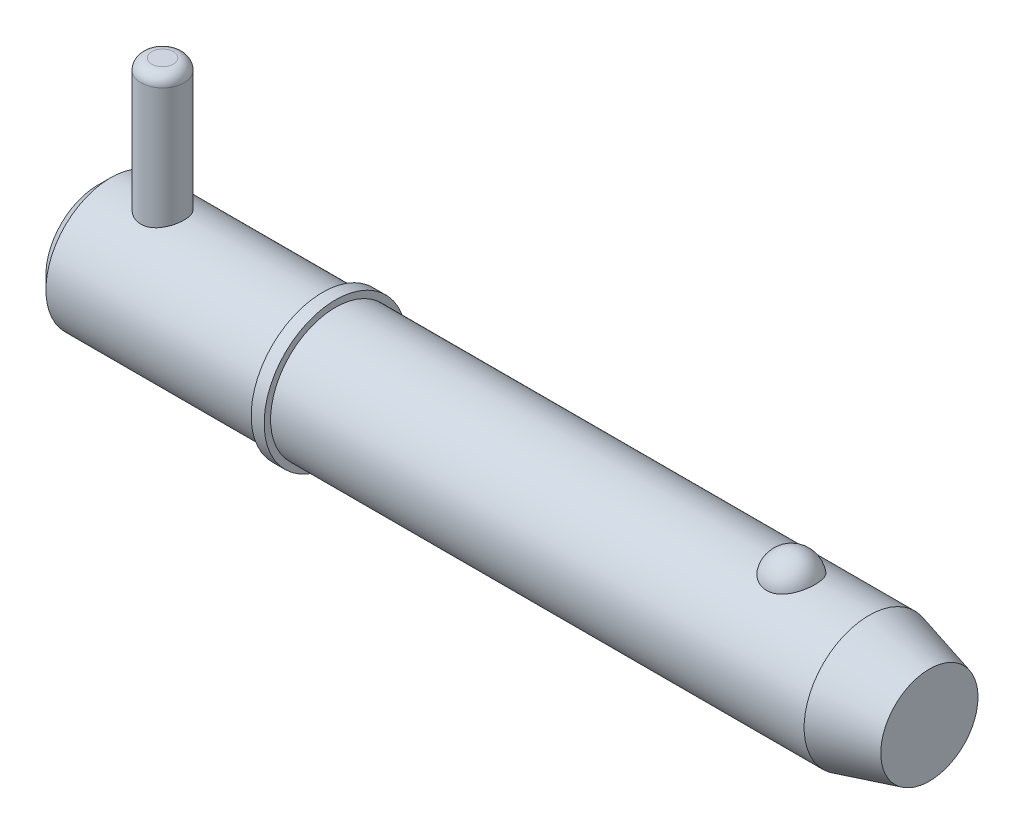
ISO-10303-21;
HEADER;
FILE_DESCRIPTION(('STEP AP214'),'2;1');
FILE_NAME('part.step','',(''),(''),'','','');
FILE_SCHEMA(('AUTOMOTIVE_DESIGN { 1 0 10303 214 1 1 1 1 }'));
ENDSEC;
DATA;
#1=APPLICATION_CONTEXT('core data for automotive mechanical design processes');
#2=APPLICATION_PROTOCOL_DEFINITION('international standard','automotive_design',2000,#1);
#3=PRODUCT_CONTEXT('',#1,'mechanical');
#4=PRODUCT('Part','Part','',(#3));
#5=PRODUCT_RELATED_PRODUCT_CATEGORY('part','',(#4));
#6=PRODUCT_DEFINITION_FORMATION('','',#4);
#7=PRODUCT_DEFINITION_CONTEXT('part definition',#1,'design');
#8=PRODUCT_DEFINITION('design','',#6,#7);
#9=PRODUCT_DEFINITION_SHAPE('','',#8);
#10=(LENGTH_UNIT() NAMED_UNIT(*) SI_UNIT(.MILLI.,.METRE.));
#11=(NAMED_UNIT(*) PLANE_ANGLE_UNIT() SI_UNIT($,.RADIAN.));
#12=(NAMED_UNIT(*) SI_UNIT($,.STERADIAN.) SOLID_ANGLE_UNIT());
#13=UNCERTAINTY_MEASURE_WITH_UNIT(LENGTH_MEASURE(1.E-05),#10,'distance_accuracy_value','');
#14=(GEOMETRIC_REPRESENTATION_CONTEXT(3) GLOBAL_UNCERTAINTY_ASSIGNED_CONTEXT((#13)) GLOBAL_UNIT_ASSIGNED_CONTEXT((#10,
#11,#12)) REPRESENTATION_CONTEXT('',''));
#15=CARTESIAN_POINT('',(0.,0.,0.));
#16=DIRECTION('',(0.,0.,1.));
#17=DIRECTION('',(1.,0.,0.));
#18=AXIS2_PLACEMENT_3D('',#15,#16,#17);
#19=CARTESIAN_POINT('',(9.525,28.575,0.));
#20=DIRECTION('',(0.,-1.,0.));
#21=DIRECTION('',(0.,0.,-1.));
#22=AXIS2_PLACEMENT_3D('',#19,#20,#21);
#23=CYLINDRICAL_SURFACE('',#22,3.175);
#24=CARTESIAN_POINT('',(9.525,-7.93750000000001,0.));
#25=DIRECTION('',(0.,1.,0.));
#26=DIRECTION('',(0.,0.,1.));
#27=AXIS2_PLACEMENT_3D('',#24,#25,#26);
#28=CIRCLE('',#27,3.175);
#29=CARTESIAN_POINT('',(9.525,-7.93750000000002,-3.175));
#30=VERTEX_POINT('',#29);
#31=EDGE_CURVE('P0_E25',#30,#30,#28,.T.);
#32=CARTESIAN_POINT('',(9.525,26.9875,0.));
#33=DIRECTION('',(0.,1.,0.));
#34=DIRECTION('',(0.,0.,1.));
#35=AXIS2_PLACEMENT_3D('',#32,#33,#34);
#36=CIRCLE('',#35,3.175);
#37=CARTESIAN_POINT('',(9.525,26.9875,-3.175));
#38=VERTEX_POINT('',#37);
#39=EDGE_CURVE('P0_E29',#38,#38,#36,.F.);
#40=CARTESIAN_POINT('',(9.525,-7.93750000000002,-3.175));
#41=CARTESIAN_POINT('',(9.525,-7.57369791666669,-3.175));
#42=CARTESIAN_POINT('',(9.525,-7.20989583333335,-3.175));
#43=CARTESIAN_POINT('',(9.525,-6.48229166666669,-3.175));
#44=CARTESIAN_POINT('',(9.525,-6.11848958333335,-3.175));
#45=CARTESIAN_POINT('',(9.525,-5.39088541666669,-3.175));
#46=CARTESIAN_POINT('',(9.525,-5.02708333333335,-3.175));
#47=CARTESIAN_POINT('',(9.525,-4.29947916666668,-3.175));
#48=CARTESIAN_POINT('',(9.525,-3.93567708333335,-3.175));
#49=CARTESIAN_POINT('',(9.525,-3.20807291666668,-3.175));
#50=CARTESIAN_POINT('',(9.525,-2.84427083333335,-3.175));
#51=CARTESIAN_POINT('',(9.525,-2.11666666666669,-3.175));
#52=CARTESIAN_POINT('',(9.525,-1.75286458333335,-3.175));
#53=CARTESIAN_POINT('',(9.525,-1.02526041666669,-3.175));
#54=CARTESIAN_POINT('',(9.525,-0.661458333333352,-3.175));
#55=CARTESIAN_POINT('',(9.525,0.0661458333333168,-3.175));
#56=CARTESIAN_POINT('',(9.525,0.429947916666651,-3.175));
#57=CARTESIAN_POINT('',(9.525,1.15755208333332,-3.175));
#58=CARTESIAN_POINT('',(9.525,1.52135416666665,-3.175));
#59=CARTESIAN_POINT('',(9.525,2.24895833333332,-3.175));
#60=CARTESIAN_POINT('',(9.525,2.61276041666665,-3.175));
#61=CARTESIAN_POINT('',(9.525,3.34036458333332,-3.175));
#62=CARTESIAN_POINT('',(9.525,3.70416666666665,-3.175));
#63=CARTESIAN_POINT('',(9.525,4.43177083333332,-3.175));
#64=CARTESIAN_POINT('',(9.525,4.79557291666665,-3.175));
#65=CARTESIAN_POINT('',(9.525,5.52317708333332,-3.175));
#66=CARTESIAN_POINT('',(9.525,5.88697916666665,-3.175));
#67=CARTESIAN_POINT('',(9.525,6.61458333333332,-3.175));
#68=CARTESIAN_POINT('',(9.525,6.97838541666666,-3.175));
#69=CARTESIAN_POINT('',(9.525,7.70598958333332,-3.175));
#70=CARTESIAN_POINT('',(9.525,8.06979166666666,-3.175));
#71=CARTESIAN_POINT('',(9.525,8.79739583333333,-3.175));
#72=CARTESIAN_POINT('',(9.525,9.16119791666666,-3.175));
#73=CARTESIAN_POINT('',(9.525,9.88880208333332,-3.175));
#74=CARTESIAN_POINT('',(9.525,10.2526041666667,-3.175));
#75=CARTESIAN_POINT('',(9.525,10.9802083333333,-3.175));
#76=CARTESIAN_POINT('',(9.525,11.3440104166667,-3.175));
#77=CARTESIAN_POINT('',(9.525,12.0716145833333,-3.175));
#78=CARTESIAN_POINT('',(9.525,12.4354166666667,-3.175));
#79=CARTESIAN_POINT('',(9.525,13.1630208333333,-3.175));
#80=CARTESIAN_POINT('',(9.525,13.5268229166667,-3.175));
#81=CARTESIAN_POINT('',(9.525,14.2544270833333,-3.175));
#82=CARTESIAN_POINT('',(9.525,14.6182291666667,-3.175));
#83=CARTESIAN_POINT('',(9.525,15.3458333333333,-3.175));
#84=CARTESIAN_POINT('',(9.525,15.7096354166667,-3.175));
#85=CARTESIAN_POINT('',(9.525,16.4372395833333,-3.175));
#86=CARTESIAN_POINT('',(9.525,16.8010416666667,-3.175));
#87=CARTESIAN_POINT('',(9.525,17.5286458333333,-3.175));
#88=CARTESIAN_POINT('',(9.525,17.8924479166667,-3.175));
#89=CARTESIAN_POINT('',(9.525,18.6200520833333,-3.175));
#90=CARTESIAN_POINT('',(9.525,18.9838541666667,-3.175));
#91=CARTESIAN_POINT('',(9.525,19.7114583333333,-3.175));
#92=CARTESIAN_POINT('',(9.525,20.0752604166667,-3.175));
#93=CARTESIAN_POINT('',(9.525,20.8028645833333,-3.175));
#94=CARTESIAN_POINT('',(9.525,21.1666666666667,-3.175));
#95=CARTESIAN_POINT('',(9.525,21.8942708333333,-3.175));
#96=CARTESIAN_POINT('',(9.525,22.2580729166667,-3.175));
#97=CARTESIAN_POINT('',(9.525,22.9856770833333,-3.175));
#98=CARTESIAN_POINT('',(9.525,23.3494791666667,-3.175));
#99=CARTESIAN_POINT('',(9.525,24.0770833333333,-3.175));
#100=CARTESIAN_POINT('',(9.525,24.4408854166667,-3.175));
#101=CARTESIAN_POINT('',(9.525,25.1684895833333,-3.175));
#102=CARTESIAN_POINT('',(9.525,25.5322916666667,-3.175));
#103=CARTESIAN_POINT('',(9.525,26.2598958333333,-3.175));
#104=CARTESIAN_POINT('',(9.525,26.6236979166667,-3.175));
#105=CARTESIAN_POINT('',(9.525,26.9875,-3.175));
#106=B_SPLINE_CURVE_WITH_KNOTS('',3,(#40,#41,#42,#43,#44,#45,#46,#47,#48,#49,#50,#51,#52,#53,
#54,#55,#56,#57,#58,#59,#60,#61,#62,#63,#64,#65,#66,#67,#68,#69,#70,#71,#72,#73,#74,#75,#76,#77,
#78,#79,#80,#81,#82,#83,#84,#85,#86,#87,#88,#89,#90,#91,#92,#93,#94,#95,#96,#97,#98,#99,#100,
#101,#102,#103,#104,#105),.UNSPECIFIED.,.F.,.F.,(4,2,2,2,2,2,2,2,2,2,2,2,2,2,2,2,2,2,2,2,2,2,2,
2,2,2,2,2,2,2,2,2,4),(0.,1.09140625,2.1828125,3.27421875,4.365625,5.45703125,6.5484375,
7.63984375,8.73125000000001,9.82265625,10.9140625,12.00546875,13.096875,14.18828125,15.2796875,
16.37109375,17.4625,18.55390625,19.6453125,20.73671875,21.828125,22.91953125,24.0109375,
25.10234375,26.19375,27.28515625,28.3765625,29.46796875,30.559375,31.65078125,32.7421875,
33.83359375,34.925),.UNSPECIFIED.);
#107=EDGE_CURVE('P0_BSEAM14',#30,#38,#106,.T.);
#108=ORIENTED_EDGE('',*,*,#31,.T.);
#109=ORIENTED_EDGE('',*,*,#39,.T.);
#110=ORIENTED_EDGE('',*,*,#107,.T.);
#111=ORIENTED_EDGE('',*,*,#107,.F.);
#112=EDGE_LOOP('',(#108,#110,#109,#111));
#113=FACE_BOUND('',#112,.T.);
#114=ADVANCED_FACE('P0_F14',(#113),#23,.T.);
#115=CARTESIAN_POINT('',(9.525,28.575,0.));
#116=DIRECTION('',(0.,1.,0.));
#117=DIRECTION('',(0.,0.,1.));
#118=AXIS2_PLACEMENT_3D('',#115,#116,#117);
#119=PLANE('',#118);
#120=CARTESIAN_POINT('',(9.525,28.575,0.));
#121=DIRECTION('',(0.,1.,0.));
#122=DIRECTION('',(0.,0.,1.));
#123=AXIS2_PLACEMENT_3D('',#120,#121,#122);
#124=CIRCLE('',#123,1.5875);
#125=CARTESIAN_POINT('',(9.525,28.575,1.5875));
#126=VERTEX_POINT('',#125);
#127=EDGE_CURVE('P0_E10',#126,#126,#124,.T.);
#128=ORIENTED_EDGE('',*,*,#127,.T.);
#129=EDGE_LOOP('',(#128));
#130=FACE_BOUND('',#129,.T.);
#131=ADVANCED_FACE('P0_F46',(#130),#119,.T.);
#132=CARTESIAN_POINT('',(9.525,-9.525,0.));
#133=DIRECTION('',(0.,1.,0.));
#134=DIRECTION('',(0.,0.,1.));
#135=AXIS2_PLACEMENT_3D('',#132,#133,#134);
#136=PLANE('',#135);
#137=CARTESIAN_POINT('',(9.525,-9.525,0.));
#138=DIRECTION('',(0.,1.,0.));
#139=DIRECTION('',(0.,0.,1.));
#140=AXIS2_PLACEMENT_3D('',#137,#138,#139);
#141=CIRCLE('',#140,1.5875);
#142=CARTESIAN_POINT('',(9.525,-9.525,1.5875));
#143=VERTEX_POINT('',#142);
#144=EDGE_CURVE('P0_E21',#143,#143,#141,.F.);
#145=ORIENTED_EDGE('',*,*,#144,.T.);
#146=EDGE_LOOP('',(#145));
#147=FACE_BOUND('',#146,.T.);
#148=ADVANCED_FACE('P0_F43',(#147),#136,.F.);
#149=CARTESIAN_POINT('',(9.525,-7.9375,0.));
#150=DIRECTION('',(0.,1.,0.));
#151=DIRECTION('',(0.,0.,1.));
#152=AXIS2_PLACEMENT_3D('',#149,#150,#151);
#153=DEGENERATE_TOROIDAL_SURFACE('',#152,1.5875,1.5875,.T.);
#154=ORIENTED_EDGE('',*,*,#144,.F.);
#155=EDGE_LOOP('',(#154));
#156=FACE_BOUND('',#155,.T.);
#157=ORIENTED_EDGE('',*,*,#31,.F.);
#158=EDGE_LOOP('',(#157));
#159=FACE_BOUND('',#158,.T.);
#160=ADVANCED_FACE('P0_F38',(#156,#159),#153,.T.);
#161=CARTESIAN_POINT('',(9.525,26.9875,0.));
#162=DIRECTION('',(0.,1.,0.));
#163=DIRECTION('',(0.,0.,1.));
#164=AXIS2_PLACEMENT_3D('',#161,#162,#163);
#165=DEGENERATE_TOROIDAL_SURFACE('',#164,1.5875,1.5875,.T.);
#166=ORIENTED_EDGE('',*,*,#39,.F.);
#167=EDGE_LOOP('',(#166));
#168=FACE_BOUND('',#167,.T.);
#169=ORIENTED_EDGE('',*,*,#127,.F.);
#170=EDGE_LOOP('',(#169));
#171=FACE_BOUND('',#170,.T.);
#172=ADVANCED_FACE('P0_F16',(#168,#171),#165,.T.);
#173=CLOSED_SHELL('',(#114,#131,#148,#160,#172));
#174=MANIFOLD_SOLID_BREP('P0_B1',#173);
#175=CARTESIAN_POINT('',(0.,0.,0.));
#176=DIRECTION('',(1.,0.,0.));
#177=DIRECTION('',(0.,0.,-1.));
#178=AXIS2_PLACEMENT_3D('',#175,#176,#177);
#179=CYLINDRICAL_SURFACE('',#178,9.525);
#180=CARTESIAN_POINT('',(113.343054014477,0.,0.));
#181=DIRECTION('',(1.,0.,0.));
#182=DIRECTION('',(0.,0.,-1.));
#183=AXIS2_PLACEMENT_3D('',#180,#181,#182);
#184=CIRCLE('',#183,9.525);
#185=CARTESIAN_POINT('',(113.343054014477,0.,-9.525));
#186=VERTEX_POINT('',#185);
#187=EDGE_CURVE('P1_E81',#186,#186,#184,.T.);
#188=ORIENTED_EDGE('',*,*,#187,.F.);
#189=EDGE_LOOP('',(#188));
#190=FACE_BOUND('',#189,.T.);
#191=CARTESIAN_POINT('',(34.93,0.,0.));
#192=DIRECTION('',(1.,0.,0.));
#193=DIRECTION('',(0.,0.,-1.));
#194=AXIS2_PLACEMENT_3D('',#191,#192,#193);
#195=CIRCLE('',#194,9.525);
#196=CARTESIAN_POINT('',(34.93,0.,-9.525));
#197=VERTEX_POINT('',#196);
#198=EDGE_CURVE('P1_E85',#197,#197,#195,.T.);
#199=ORIENTED_EDGE('',*,*,#198,.T.);
#200=EDGE_LOOP('',(#199));
#201=FACE_BOUND('',#200,.T.);
#202=CARTESIAN_POINT('',(101.945757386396,8.80405803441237,3.63513233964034));
#203=CARTESIAN_POINT('',(101.851676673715,8.80405953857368,3.63513053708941));
#204=CARTESIAN_POINT('',(101.757561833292,8.80561325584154,3.63137461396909));
#205=CARTESIAN_POINT('',(101.570012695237,8.81177748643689,3.61638665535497));
#206=CARTESIAN_POINT('',(101.476578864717,8.81638992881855,3.60514990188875));
#207=CARTESIAN_POINT('',(101.197945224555,8.83467114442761,3.56024627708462));
#208=CARTESIAN_POINT('',(101.014691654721,8.85278327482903,3.5153862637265));
#209=CARTESIAN_POINT('',(100.659509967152,8.89871214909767,3.39742145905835));
#210=CARTESIAN_POINT('',(100.487553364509,8.92650327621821,3.32439116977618));
#211=CARTESIAN_POINT('',(100.158707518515,8.98874819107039,3.15220244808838));
#212=CARTESIAN_POINT('',(100.001811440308,9.02319893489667,3.05305594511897));
#213=CARTESIAN_POINT('',(99.7022147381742,9.09629186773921,2.82797815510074));
#214=CARTESIAN_POINT('',(99.5600600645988,9.13502685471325,2.70135138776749));
#215=CARTESIAN_POINT('',(99.2982999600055,9.2118657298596,2.42641932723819));
#216=CARTESIAN_POINT('',(99.1787015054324,9.2499694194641,2.27810735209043));
#217=CARTESIAN_POINT('',(98.959645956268,9.32341082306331,1.95652290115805));
#218=CARTESIAN_POINT('',(98.8613174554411,9.35855090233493,1.78243511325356));
#219=CARTESIAN_POINT('',(98.6938190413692,9.42045142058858,1.41937246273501));
#220=CARTESIAN_POINT('',(98.6246511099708,9.44721128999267,1.23039658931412));
#221=CARTESIAN_POINT('',(98.5161994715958,9.48990641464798,0.84037088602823));
#222=CARTESIAN_POINT('',(98.4772880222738,9.50570658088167,0.639202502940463));
#223=CARTESIAN_POINT('',(98.4315550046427,9.52433146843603,0.23266436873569));
#224=CARTESIAN_POINT('',(98.4247324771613,9.52715657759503,0.0272947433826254));
#225=CARTESIAN_POINT('',(98.443255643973,9.51956918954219,-0.380478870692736));
#226=CARTESIAN_POINT('',(98.4684052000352,9.50923740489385,-0.582893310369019));
#227=CARTESIAN_POINT('',(98.5500253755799,9.47651897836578,-0.980293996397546));
#228=CARTESIAN_POINT('',(98.6064966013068,9.45413210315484,-1.17528009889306));
#229=CARTESIAN_POINT('',(98.7497192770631,9.39954044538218,-1.55263697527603));
#230=CARTESIAN_POINT('',(98.8365124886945,9.36732213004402,-1.73498993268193));
#231=CARTESIAN_POINT('',(99.0386103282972,9.29640700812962,-2.08177763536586));
#232=CARTESIAN_POINT('',(99.1539172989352,9.25770966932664,-2.24621090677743));
#233=CARTESIAN_POINT('',(99.411264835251,9.17775604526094,-2.55338333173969));
#234=CARTESIAN_POINT('',(99.5534344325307,9.136488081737,-2.69601150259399));
#235=CARTESIAN_POINT('',(99.86089985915,9.05620497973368,-2.95451229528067));
#236=CARTESIAN_POINT('',(100.026193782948,9.01718965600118,-3.070387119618));
#237=CARTESIAN_POINT('',(100.372052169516,8.94680019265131,-3.26976836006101));
#238=CARTESIAN_POINT('',(100.552227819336,8.91528408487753,-3.353897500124));
#239=CARTESIAN_POINT('',(100.925651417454,8.86272514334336,-3.49043503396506));
#240=CARTESIAN_POINT('',(101.118894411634,8.84167836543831,-3.54285537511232));
#241=CARTESIAN_POINT('',(101.502503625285,8.81348056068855,-3.61241306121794));
#242=CARTESIAN_POINT('',(101.692525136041,8.80568348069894,-3.6311933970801));
#243=CARTESIAN_POINT('',(102.073190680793,8.80289410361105,-3.63795342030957));
#244=CARTESIAN_POINT('',(102.263834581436,8.80789922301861,-3.62593932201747));
#245=CARTESIAN_POINT('',(102.634007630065,8.82974915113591,-3.57238430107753));
#246=CARTESIAN_POINT('',(102.813697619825,8.84621463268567,-3.53178890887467));
#247=CARTESIAN_POINT('',(103.163422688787,8.88875330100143,-3.42331083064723));
#248=CARTESIAN_POINT('',(103.333456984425,8.91482726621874,-3.35542593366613));
#249=CARTESIAN_POINT('',(103.663237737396,8.97448239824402,-3.19248225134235));
#250=CARTESIAN_POINT('',(103.822680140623,9.00821446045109,-3.0968647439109));
#251=CARTESIAN_POINT('',(104.123513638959,9.07935398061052,-2.88162736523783));
#252=CARTESIAN_POINT('',(104.264900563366,9.11676228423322,-2.76200196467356));
#253=CARTESIAN_POINT('',(104.53331931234,9.19347419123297,-2.49516285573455));
#254=CARTESIAN_POINT('',(104.659275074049,9.23277872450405,-2.34686614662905));
#255=CARTESIAN_POINT('',(104.885522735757,9.3073761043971,-2.0309368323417));
#256=CARTESIAN_POINT('',(104.98581004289,9.34266823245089,-1.86330077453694));
#257=CARTESIAN_POINT('',(105.161514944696,9.40674710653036,-1.50744893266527));
#258=CARTESIAN_POINT('',(105.236041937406,9.43529176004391,-1.31874876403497));
#259=CARTESIAN_POINT('',(105.35416505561,9.48144132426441,-0.930631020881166));
#260=CARTESIAN_POINT('',(105.397760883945,9.49904612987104,-0.73121334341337));
#261=CARTESIAN_POINT('',(105.453158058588,9.5215314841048,-0.327147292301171));
#262=CARTESIAN_POINT('',(105.464935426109,9.52640243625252,-0.12249509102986));
#263=CARTESIAN_POINT('',(105.456382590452,9.5228957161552,0.286018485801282));
#264=CARTESIAN_POINT('',(105.43605305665,9.5145183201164,0.489879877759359));
#265=CARTESIAN_POINT('',(105.363884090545,9.48544083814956,0.889994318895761));
#266=CARTESIAN_POINT('',(105.312199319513,9.46480124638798,1.08627971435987));
#267=CARTESIAN_POINT('',(105.178491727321,9.41333895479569,1.46682086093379));
#268=CARTESIAN_POINT('',(105.096466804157,9.38251554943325,1.65107577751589));
#269=CARTESIAN_POINT('',(104.90319292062,9.31365636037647,2.00346348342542));
#270=CARTESIAN_POINT('',(104.791783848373,9.27558138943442,2.17150083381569));
#271=CARTESIAN_POINT('',(104.542294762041,9.19638714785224,2.48563115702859));
#272=CARTESIAN_POINT('',(104.404216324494,9.15526805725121,2.63172542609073));
#273=CARTESIAN_POINT('',(104.104843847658,9.07465393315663,2.89750997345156));
#274=CARTESIAN_POINT('',(103.943610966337,9.03515496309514,3.01726776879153));
#275=CARTESIAN_POINT('',(103.601613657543,8.96227564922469,3.22732920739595));
#276=CARTESIAN_POINT('',(103.420841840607,8.92889763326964,3.31762165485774));
#277=CARTESIAN_POINT('',(103.051445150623,8.8734538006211,3.46314419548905));
#278=CARTESIAN_POINT('',(102.86332371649,8.85102983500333,3.51950082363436));
#279=CARTESIAN_POINT('',(102.57578699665,8.8266696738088,3.57993683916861));
#280=CARTESIAN_POINT('',(102.479133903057,8.82009725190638,3.5960621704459));
#281=CARTESIAN_POINT('',(102.284677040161,8.81020897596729,3.62022512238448));
#282=CARTESIAN_POINT('',(102.18687410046,8.80689090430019,3.62826825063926));
#283=CARTESIAN_POINT('',(102.041224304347,8.80445615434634,3.63416760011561));
#284=CARTESIAN_POINT('',(101.993495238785,8.80405727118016,3.63513325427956));
#285=CARTESIAN_POINT('',(101.945757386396,8.80405803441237,3.63513233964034));
#286=B_SPLINE_CURVE_WITH_KNOTS('',3,(#202,#203,#204,#205,#206,#207,#208,#209,#210,#211,#212,
#213,#214,#215,#216,#217,#218,#219,#220,#221,#222,#223,#224,#225,#226,#227,#228,#229,#230,#231,
#232,#233,#234,#235,#236,#237,#238,#239,#240,#241,#242,#243,#244,#245,#246,#247,#248,#249,#250,
#251,#252,#253,#254,#255,#256,#257,#258,#259,#260,#261,#262,#263,#264,#265,#266,#267,#268,#269,
#270,#271,#272,#273,#274,#275,#276,#277,#278,#279,#280,#281,#282,#283,#284,#285),.UNSPECIFIED.,
.T.,.F.,(4,2,2,2,2,2,2,2,2,2,2,2,2,2,2,2,2,2,2,2,2,2,2,2,2,2,2,2,2,2,2,2,2,2,2,2,2,2,2,2,2,4),
(0.,0.282202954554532,0.564584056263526,1.13017050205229,1.69427128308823,2.25811483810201,
2.83836627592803,3.4187968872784,4.02497117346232,4.63118665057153,5.24474754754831,
5.85829010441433,6.46808687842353,7.07789545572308,7.68854723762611,8.29924920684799,
8.91296283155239,9.52662591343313,10.1275338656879,10.7282152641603,11.2986646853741,
11.8689989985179,12.4213015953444,12.973648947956,13.5380053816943,14.1024919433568,
14.695298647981,15.2882113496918,15.8999469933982,16.5116885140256,17.1238909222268,
17.7360805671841,18.3452748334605,18.9545113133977,19.567138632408,20.179729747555,
20.7907316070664,21.4019653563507,21.9915938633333,22.2859053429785,22.5800161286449,
22.7232098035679),.UNSPECIFIED.);
#287=CARTESIAN_POINT('',(101.945757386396,8.80405803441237,3.63513233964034));
#288=VERTEX_POINT('',#287);
#289=EDGE_CURVE('P1_E35',#288,#288,#286,.T.);
#290=ORIENTED_EDGE('',*,*,#289,.T.);
#291=EDGE_LOOP('',(#290));
#292=FACE_BOUND('',#291,.T.);
#293=ADVANCED_FACE('P1_F13',(#190,#201,#292),#179,.T.);
#294=CARTESIAN_POINT('',(0.,0.,0.));
#295=DIRECTION('',(-1.,0.,0.));
#296=DIRECTION('',(0.,0.,1.));
#297=AXIS2_PLACEMENT_3D('',#294,#295,#296);
#298=PLANE('',#297);
#299=CARTESIAN_POINT('',(0.,0.,0.));
#300=DIRECTION('',(1.,0.,0.));
#301=DIRECTION('',(0.,0.,-1.));
#302=AXIS2_PLACEMENT_3D('',#299,#300,#301);
#303=CIRCLE('',#302,7.62);
#304=CARTESIAN_POINT('',(0.,0.,-7.62));
#305=VERTEX_POINT('',#304);
#306=EDGE_CURVE('P1_E9',#305,#305,#303,.T.);
#307=ORIENTED_EDGE('',*,*,#306,.F.);
#308=EDGE_LOOP('',(#307));
#309=FACE_BOUND('',#308,.T.);
#310=ADVANCED_FACE('P1_F15',(#309),#298,.T.);
#311=CARTESIAN_POINT('',(1.90499999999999,0.,0.));
#312=DIRECTION('',(1.,0.,0.));
#313=DIRECTION('',(0.,0.,-1.));
#314=AXIS2_PLACEMENT_3D('',#311,#312,#313);
#315=CONICAL_SURFACE('',#314,9.525,0.785398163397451);
#316=ORIENTED_EDGE('',*,*,#306,.T.);
#317=EDGE_LOOP('',(#316));
#318=FACE_BOUND('',#317,.T.);
#319=CARTESIAN_POINT('',(1.90499999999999,0.,0.));
#320=DIRECTION('',(1.,0.,0.));
#321=DIRECTION('',(0.,0.,-1.));
#322=AXIS2_PLACEMENT_3D('',#319,#320,#321);
#323=CIRCLE('',#322,9.525);
#324=CARTESIAN_POINT('',(1.90499999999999,0.,-9.525));
#325=VERTEX_POINT('',#324);
#326=EDGE_CURVE('P1_E26',#325,#325,#323,.T.);
#327=ORIENTED_EDGE('',*,*,#326,.F.);
#328=EDGE_LOOP('',(#327));
#329=FACE_BOUND('',#328,.T.);
#330=ADVANCED_FACE('P1_F77',(#318,#329),#315,.T.);
#331=CARTESIAN_POINT('',(0.,0.,0.));
#332=DIRECTION('',(1.,0.,0.));
#333=DIRECTION('',(0.,0.,-1.));
#334=AXIS2_PLACEMENT_3D('',#331,#332,#333);
#335=CYLINDRICAL_SURFACE('',#334,9.525);
#336=CARTESIAN_POINT('',(9.525,-8.98025612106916,3.175));
#337=CARTESIAN_POINT('',(9.35206354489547,-8.98025555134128,3.17500081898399));
#338=CARTESIAN_POINT('',(9.17913201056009,-8.98530617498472,3.16082293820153));
#339=CARTESIAN_POINT('',(8.83839221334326,-9.00485797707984,3.10467734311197));
#340=CARTESIAN_POINT('',(8.67058479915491,-9.0193607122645,3.06270505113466));
#341=CARTESIAN_POINT('',(8.34508461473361,-9.05599546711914,2.95260866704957));
#342=CARTESIAN_POINT('',(8.18737272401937,-9.07811252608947,2.88453582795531));
#343=CARTESIAN_POINT('',(7.88555684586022,-9.12746212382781,2.72434567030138));
#344=CARTESIAN_POINT('',(7.74145587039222,-9.1546957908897,2.63222304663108));
#345=CARTESIAN_POINT('',(7.46531411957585,-9.21240503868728,2.42268738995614));
#346=CARTESIAN_POINT('',(7.33388351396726,-9.24296141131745,2.30449228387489));
#347=CARTESIAN_POINT('',(7.09229340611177,-9.30319020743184,2.0478358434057));
#348=CARTESIAN_POINT('',(6.98213731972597,-9.33286248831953,1.90937126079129));
#349=CARTESIAN_POINT('',(6.78345450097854,-9.38891527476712,1.61164431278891));
#350=CARTESIAN_POINT('',(6.69556709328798,-9.41518969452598,1.45193356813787));
#351=CARTESIAN_POINT('',(6.54814671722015,-9.46053437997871,1.11896913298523));
#352=CARTESIAN_POINT('',(6.48860610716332,-9.47960658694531,0.945719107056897));
#353=CARTESIAN_POINT('',(6.40163866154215,-9.50782564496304,0.596991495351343));
#354=CARTESIAN_POINT('',(6.373166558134,-9.5172947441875,0.421801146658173));
#355=CARTESIAN_POINT('',(6.3458207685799,-9.52638456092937,0.068890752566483));
#356=CARTESIAN_POINT('',(6.34693945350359,-9.52600781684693,-0.108828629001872));
#357=CARTESIAN_POINT('',(6.37808050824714,-9.51566675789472,-0.454353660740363));
#358=CARTESIAN_POINT('',(6.4069675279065,-9.50607905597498,-0.622274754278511));
#359=CARTESIAN_POINT('',(6.490947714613,-9.47886621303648,-0.950732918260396));
#360=CARTESIAN_POINT('',(6.54604265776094,-9.46124052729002,-1.11126948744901));
#361=CARTESIAN_POINT('',(6.68153768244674,-9.41945253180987,-1.42288410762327));
#362=CARTESIAN_POINT('',(6.76226085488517,-9.3952073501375,-1.57381010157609));
#363=CARTESIAN_POINT('',(6.94645456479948,-9.34270397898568,-1.86030973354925));
#364=CARTESIAN_POINT('',(7.04993142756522,-9.31444467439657,-1.99587908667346));
#365=CARTESIAN_POINT('',(7.28241619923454,-9.25532159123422,-2.2545702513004));
#366=CARTESIAN_POINT('',(7.4123967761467,-9.22439783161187,-2.37680549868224));
#367=CARTESIAN_POINT('',(7.69127470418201,-9.1645528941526,-2.5980302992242));
#368=CARTESIAN_POINT('',(7.84017496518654,-9.13563202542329,-2.6970162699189));
#369=CARTESIAN_POINT('',(8.15547526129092,-9.08273917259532,-2.87016016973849));
#370=CARTESIAN_POINT('',(8.32209451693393,-9.05884361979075,-2.94394402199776));
#371=CARTESIAN_POINT('',(8.66638917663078,-9.01959241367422,-3.06210713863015));
#372=CARTESIAN_POINT('',(8.84405991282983,-9.00423318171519,-3.10649872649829));
#373=CARTESIAN_POINT('',(9.19682677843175,-8.98460345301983,-3.16281207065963));
#374=CARTESIAN_POINT('',(9.37167742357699,-8.9798639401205,-3.17610837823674));
#375=CARTESIAN_POINT('',(9.72113927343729,-8.9806993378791,-3.17374726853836));
#376=CARTESIAN_POINT('',(9.89575051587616,-8.98627237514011,-3.15809511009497));
#377=CARTESIAN_POINT('',(10.2335233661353,-9.00663737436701,-3.09951644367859));
#378=CARTESIAN_POINT('',(10.3968722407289,-9.02110608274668,-3.05754530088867));
#379=CARTESIAN_POINT('',(10.7141759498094,-9.05727657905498,-2.94866651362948));
#380=CARTESIAN_POINT('',(10.8681291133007,-9.07897964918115,-2.88175444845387));
#381=CARTESIAN_POINT('',(11.1676828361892,-9.12802586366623,-2.72248103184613));
#382=CARTESIAN_POINT('',(11.3128635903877,-9.1555260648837,-2.62937980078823));
#383=CARTESIAN_POINT('',(11.5860387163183,-9.21276315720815,-2.42120937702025));
#384=CARTESIAN_POINT('',(11.7140280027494,-9.24250070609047,-2.30613370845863));
#385=CARTESIAN_POINT('',(11.9555513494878,-9.30259247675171,-2.05070616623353));
#386=CARTESIAN_POINT('',(12.0680936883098,-9.33290753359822,-1.90940458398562));
#387=CARTESIAN_POINT('',(12.267933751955,-9.3893275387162,-1.60917665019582));
#388=CARTESIAN_POINT('',(12.3552323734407,-9.41543263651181,-1.45025092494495));
#389=CARTESIAN_POINT('',(12.5013088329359,-9.46036988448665,-1.12007606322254));
#390=CARTESIAN_POINT('',(12.5602723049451,-9.47924920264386,-0.9489158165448));
#391=CARTESIAN_POINT('',(12.6483355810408,-9.50781089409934,-0.598355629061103));
#392=CARTESIAN_POINT('',(12.6774461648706,-9.5174965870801,-0.4189586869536));
#393=CARTESIAN_POINT('',(12.7040070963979,-9.52632915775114,-0.066088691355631));
#394=CARTESIAN_POINT('',(12.7028811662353,-9.52594996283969,0.107266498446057));
#395=CARTESIAN_POINT('',(12.6725130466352,-9.51586223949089,0.451202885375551));
#396=CARTESIAN_POINT('',(12.643273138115,-9.50615446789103,0.621784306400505));
#397=CARTESIAN_POINT('',(12.5584514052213,-9.47867404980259,0.952633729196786));
#398=CARTESIAN_POINT('',(12.5032953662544,-9.46103195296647,1.1130225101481));
#399=CARTESIAN_POINT('',(12.3686013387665,-9.41949985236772,1.42233126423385));
#400=CARTESIAN_POINT('',(12.2890589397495,-9.39560871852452,1.57124915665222));
#401=CARTESIAN_POINT('',(12.1044667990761,-9.34294133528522,1.85938800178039));
#402=CARTESIAN_POINT('',(11.9985831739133,-9.31401720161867,1.9980473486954));
#403=CARTESIAN_POINT('',(11.7657327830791,-9.25490239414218,2.25609475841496));
#404=CARTESIAN_POINT('',(11.6387592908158,-9.22471131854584,2.37547664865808));
#405=CARTESIAN_POINT('',(11.3613902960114,-9.16505913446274,2.59633024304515));
#406=CARTESIAN_POINT('',(11.2102725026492,-9.13567286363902,2.69691791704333));
#407=CARTESIAN_POINT('',(10.8923631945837,-9.08241113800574,2.87119803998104));
#408=CARTESIAN_POINT('',(10.7255757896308,-9.05853424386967,2.94489751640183));
#409=CARTESIAN_POINT('',(10.3887212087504,-9.02021736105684,3.06020415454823));
#410=CARTESIAN_POINT('',(10.219143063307,-9.00539959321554,3.10311136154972));
#411=CARTESIAN_POINT('',(9.87470703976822,-8.98542092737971,3.16050396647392));
#412=CARTESIAN_POINT('',(9.699851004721,-8.98025669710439,3.17499917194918));
#413=CARTESIAN_POINT('',(9.525,-8.98025612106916,3.175));
#414=B_SPLINE_CURVE_WITH_KNOTS('',3,(#336,#337,#338,#339,#340,#341,#342,#343,#344,#345,#346,
#347,#348,#349,#350,#351,#352,#353,#354,#355,#356,#357,#358,#359,#360,#361,#362,#363,#364,#365,
#366,#367,#368,#369,#370,#371,#372,#373,#374,#375,#376,#377,#378,#379,#380,#381,#382,#383,#384,
#385,#386,#387,#388,#389,#390,#391,#392,#393,#394,#395,#396,#397,#398,#399,#400,#401,#402,#403,
#404,#405,#406,#407,#408,#409,#410,#411,#412,#413),.UNSPECIFIED.,.T.,.F.,(4,2,2,2,2,2,2,2,2,2,2,
2,2,2,2,2,2,2,2,2,2,2,2,2,2,2,2,2,2,2,2,2,2,2,2,2,2,2,4),(0.,0.518161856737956,1.03640907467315,
1.55364379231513,2.07099270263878,2.60671746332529,3.14252816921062,3.69231882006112,
4.24196117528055,4.77247962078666,5.30286129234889,5.81244090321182,6.32205505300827,
6.83836754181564,7.3548237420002,7.89559553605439,8.43645060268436,8.98501631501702,
9.53335188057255,10.056948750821,10.5804505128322,11.0859695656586,11.5915782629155,
12.1132237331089,12.6350231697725,13.1819271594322,13.7288117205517,14.2720628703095,
14.815117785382,15.3326491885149,15.8501386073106,16.3594083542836,16.868770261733,
17.3969527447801,17.925304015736,18.4743376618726,19.023227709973,19.5473069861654,
20.0712053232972),.UNSPECIFIED.);
#415=CARTESIAN_POINT('',(9.525,-8.98025612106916,3.175));
#416=VERTEX_POINT('',#415);
#417=EDGE_CURVE('P1_E17',#416,#416,#414,.T.);
#418=ORIENTED_EDGE('',*,*,#417,.F.);
#419=EDGE_LOOP('',(#418));
#420=FACE_BOUND('',#419,.T.);
#421=CARTESIAN_POINT('',(9.525,8.98025612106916,3.175));
#422=CARTESIAN_POINT('',(9.69793645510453,8.98025555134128,3.17500081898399));
#423=CARTESIAN_POINT('',(9.87086798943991,8.98530617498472,3.16082293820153));
#424=CARTESIAN_POINT('',(10.2116077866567,9.00485797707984,3.10467734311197));
#425=CARTESIAN_POINT('',(10.3794152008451,9.0193607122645,3.06270505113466));
#426=CARTESIAN_POINT('',(10.7049153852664,9.05599546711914,2.95260866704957));
#427=CARTESIAN_POINT('',(10.8626272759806,9.07811252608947,2.88453582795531));
#428=CARTESIAN_POINT('',(11.1644431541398,9.12746212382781,2.72434567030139));
#429=CARTESIAN_POINT('',(11.3085441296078,9.15469579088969,2.63222304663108));
#430=CARTESIAN_POINT('',(11.5846858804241,9.21240503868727,2.42268738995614));
#431=CARTESIAN_POINT('',(11.7161164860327,9.24296141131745,2.30449228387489));
#432=CARTESIAN_POINT('',(11.9577065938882,9.30319020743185,2.0478358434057));
#433=CARTESIAN_POINT('',(12.067862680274,9.33286248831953,1.90937126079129));
#434=CARTESIAN_POINT('',(12.2665454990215,9.38891527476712,1.61164431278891));
#435=CARTESIAN_POINT('',(12.354432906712,9.41518969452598,1.45193356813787));
#436=CARTESIAN_POINT('',(12.5018532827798,9.46053437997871,1.11896913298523));
#437=CARTESIAN_POINT('',(12.5613938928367,9.47960658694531,0.945719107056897));
#438=CARTESIAN_POINT('',(12.6483613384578,9.50782564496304,0.596991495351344));
#439=CARTESIAN_POINT('',(12.676833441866,9.5172947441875,0.421801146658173));
#440=CARTESIAN_POINT('',(12.7041792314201,9.52638456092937,0.0688907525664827));
#441=CARTESIAN_POINT('',(12.7030605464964,9.52600781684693,-0.108828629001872));
#442=CARTESIAN_POINT('',(12.6719194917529,9.51566675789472,-0.454353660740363));
#443=CARTESIAN_POINT('',(12.6430324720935,9.50607905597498,-0.622274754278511));
#444=CARTESIAN_POINT('',(12.559052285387,9.47886621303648,-0.950732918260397));
#445=CARTESIAN_POINT('',(12.5039573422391,9.46124052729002,-1.11126948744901));
#446=CARTESIAN_POINT('',(12.3684623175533,9.41945253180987,-1.42288410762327));
#447=CARTESIAN_POINT('',(12.2877391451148,9.3952073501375,-1.57381010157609));
#448=CARTESIAN_POINT('',(12.1035454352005,9.34270397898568,-1.86030973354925));
#449=CARTESIAN_POINT('',(12.0000685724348,9.31444467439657,-1.99587908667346));
#450=CARTESIAN_POINT('',(11.7675838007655,9.25532159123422,-2.2545702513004));
#451=CARTESIAN_POINT('',(11.6376032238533,9.22439783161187,-2.37680549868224));
#452=CARTESIAN_POINT('',(11.358725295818,9.1645528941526,-2.5980302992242));
#453=CARTESIAN_POINT('',(11.2098250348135,9.13563202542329,-2.6970162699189));
#454=CARTESIAN_POINT('',(10.8945247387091,9.08273917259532,-2.87016016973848));
#455=CARTESIAN_POINT('',(10.7279054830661,9.05884361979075,-2.94394402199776));
#456=CARTESIAN_POINT('',(10.3836108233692,9.01959241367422,-3.06210713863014));
#457=CARTESIAN_POINT('',(10.2059400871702,9.00423318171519,-3.10649872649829));
#458=CARTESIAN_POINT('',(9.85317322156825,8.98460345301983,-3.16281207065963));
#459=CARTESIAN_POINT('',(9.67832257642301,8.9798639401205,-3.17610837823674));
#460=CARTESIAN_POINT('',(9.32886072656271,8.9806993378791,-3.17374726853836));
#461=CARTESIAN_POINT('',(9.15424948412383,8.98627237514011,-3.15809511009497));
#462=CARTESIAN_POINT('',(8.81647663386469,9.00663737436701,-3.09951644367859));
#463=CARTESIAN_POINT('',(8.65312775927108,9.02110608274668,-3.05754530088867));
#464=CARTESIAN_POINT('',(8.33582405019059,9.05727657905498,-2.94866651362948));
#465=CARTESIAN_POINT('',(8.18187088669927,9.07897964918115,-2.88175444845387));
#466=CARTESIAN_POINT('',(7.88231716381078,9.12802586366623,-2.72248103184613));
#467=CARTESIAN_POINT('',(7.73713640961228,9.1555260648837,-2.62937980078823));
#468=CARTESIAN_POINT('',(7.46396128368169,9.21276315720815,-2.42120937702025));
#469=CARTESIAN_POINT('',(7.33597199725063,9.24250070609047,-2.30613370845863));
#470=CARTESIAN_POINT('',(7.09444865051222,9.30259247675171,-2.05070616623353));
#471=CARTESIAN_POINT('',(6.98190631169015,9.33290753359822,-1.90940458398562));
#472=CARTESIAN_POINT('',(6.78206624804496,9.3893275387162,-1.60917665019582));
#473=CARTESIAN_POINT('',(6.6947676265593,9.41543263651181,-1.45025092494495));
#474=CARTESIAN_POINT('',(6.54869116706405,9.46036988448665,-1.12007606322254));
#475=CARTESIAN_POINT('',(6.48972769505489,9.47924920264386,-0.948915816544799));
#476=CARTESIAN_POINT('',(6.40166441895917,9.50781089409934,-0.598355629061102));
#477=CARTESIAN_POINT('',(6.3725538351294,9.5174965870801,-0.418958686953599));
#478=CARTESIAN_POINT('',(6.34599290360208,9.52632915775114,-0.0660886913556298));
#479=CARTESIAN_POINT('',(6.3471188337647,9.52594996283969,0.107266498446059));
#480=CARTESIAN_POINT('',(6.37748695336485,9.51586223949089,0.451202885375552));
#481=CARTESIAN_POINT('',(6.40672686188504,9.50615446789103,0.621784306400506));
#482=CARTESIAN_POINT('',(6.49154859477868,9.47867404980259,0.952633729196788));
#483=CARTESIAN_POINT('',(6.54670463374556,9.46103195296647,1.11302251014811));
#484=CARTESIAN_POINT('',(6.68139866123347,9.41949985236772,1.42233126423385));
#485=CARTESIAN_POINT('',(6.76094106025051,9.39560871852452,1.57124915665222));
#486=CARTESIAN_POINT('',(6.94553320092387,9.34294133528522,1.85938800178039));
#487=CARTESIAN_POINT('',(7.05141682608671,9.31401720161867,1.9980473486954));
#488=CARTESIAN_POINT('',(7.28426721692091,9.25490239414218,2.25609475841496));
#489=CARTESIAN_POINT('',(7.41124070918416,9.22471131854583,2.37547664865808));
#490=CARTESIAN_POINT('',(7.68860970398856,9.16505913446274,2.59633024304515));
#491=CARTESIAN_POINT('',(7.83972749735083,9.13567286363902,2.69691791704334));
#492=CARTESIAN_POINT('',(8.15763680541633,9.08241113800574,2.87119803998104));
#493=CARTESIAN_POINT('',(8.32442421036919,9.05853424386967,2.94489751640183));
#494=CARTESIAN_POINT('',(8.66127879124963,9.02021736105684,3.06020415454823));
#495=CARTESIAN_POINT('',(8.83085693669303,9.00539959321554,3.10311136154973));
#496=CARTESIAN_POINT('',(9.17529296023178,8.98542092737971,3.16050396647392));
#497=CARTESIAN_POINT('',(9.350148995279,8.98025669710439,3.17499917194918));
#498=CARTESIAN_POINT('',(9.525,8.98025612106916,3.175));
#499=B_SPLINE_CURVE_WITH_KNOTS('',3,(#421,#422,#423,#424,#425,#426,#427,#428,#429,#430,#431,
#432,#433,#434,#435,#436,#437,#438,#439,#440,#441,#442,#443,#444,#445,#446,#447,#448,#449,#450,
#451,#452,#453,#454,#455,#456,#457,#458,#459,#460,#461,#462,#463,#464,#465,#466,#467,#468,#469,
#470,#471,#472,#473,#474,#475,#476,#477,#478,#479,#480,#481,#482,#483,#484,#485,#486,#487,#488,
#489,#490,#491,#492,#493,#494,#495,#496,#497,#498),.UNSPECIFIED.,.T.,.F.,(4,2,2,2,2,2,2,2,2,2,2,
2,2,2,2,2,2,2,2,2,2,2,2,2,2,2,2,2,2,2,2,2,2,2,2,2,2,2,4),(0.,0.518161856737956,1.03640907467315,
1.55364379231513,2.07099270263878,2.60671746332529,3.14252816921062,3.69231882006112,
4.24196117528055,4.77247962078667,5.30286129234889,5.81244090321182,6.32205505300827,
6.83836754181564,7.3548237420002,7.89559553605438,8.43645060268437,8.98501631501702,
9.53335188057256,10.056948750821,10.5804505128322,11.0859695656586,11.5915782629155,
12.1132237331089,12.6350231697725,13.1819271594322,13.7288117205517,14.2720628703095,
14.815117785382,15.3326491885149,15.8501386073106,16.3594083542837,16.868770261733,
17.3969527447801,17.9253040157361,18.4743376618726,19.023227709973,19.5473069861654,
20.0712053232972),.UNSPECIFIED.);
#500=CARTESIAN_POINT('',(9.525,8.98025612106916,3.175));
#501=VERTEX_POINT('',#500);
#502=EDGE_CURVE('P1_E43',#501,#501,#499,.T.);
#503=ORIENTED_EDGE('',*,*,#502,.F.);
#504=EDGE_LOOP('',(#503));
#505=FACE_BOUND('',#504,.T.);
#506=ORIENTED_EDGE('',*,*,#326,.T.);
#507=EDGE_LOOP('',(#506));
#508=FACE_BOUND('',#507,.T.);
#509=CARTESIAN_POINT('',(33.025,0.,0.));
#510=DIRECTION('',(1.,0.,0.));
#511=DIRECTION('',(0.,0.,-1.));
#512=AXIS2_PLACEMENT_3D('',#509,#510,#511);
#513=CIRCLE('',#512,9.525);
#514=CARTESIAN_POINT('',(33.025,0.,-9.525));
#515=VERTEX_POINT('',#514);
#516=EDGE_CURVE('P1_E31',#515,#515,#513,.T.);
#517=ORIENTED_EDGE('',*,*,#516,.F.);
#518=EDGE_LOOP('',(#517));
#519=FACE_BOUND('',#518,.T.);
#520=ADVANCED_FACE('P1_F103',(#420,#505,#508,#519),#335,.T.);
#521=CARTESIAN_POINT('',(33.025,9.525,0.));
#522=DIRECTION('',(-1.,0.,0.));
#523=DIRECTION('',(0.,0.,1.));
#524=AXIS2_PLACEMENT_3D('',#521,#522,#523);
#525=PLANE('',#524);
#526=ORIENTED_EDGE('',*,*,#516,.T.);
#527=EDGE_LOOP('',(#526));
#528=FACE_BOUND('',#527,.T.);
#529=CARTESIAN_POINT('',(33.025,0.,0.));
#530=DIRECTION('',(1.,0.,0.));
#531=DIRECTION('',(0.,0.,-1.));
#532=AXIS2_PLACEMENT_3D('',#529,#530,#531);
#533=CIRCLE('',#532,10.4775);
#534=CARTESIAN_POINT('',(33.025,0.,-10.4775));
#535=VERTEX_POINT('',#534);
#536=EDGE_CURVE('P1_E91',#535,#535,#533,.T.);
#537=ORIENTED_EDGE('',*,*,#536,.F.);
#538=EDGE_LOOP('',(#537));
#539=FACE_BOUND('',#538,.T.);
#540=ADVANCED_FACE('P1_F100',(#528,#539),#525,.T.);
#541=CARTESIAN_POINT('',(0.,0.,0.));
#542=DIRECTION('',(1.,0.,0.));
#543=DIRECTION('',(0.,0.,-1.));
#544=AXIS2_PLACEMENT_3D('',#541,#542,#543);
#545=CYLINDRICAL_SURFACE('',#544,10.4775);
#546=ORIENTED_EDGE('',*,*,#536,.T.);
#547=EDGE_LOOP('',(#546));
#548=FACE_BOUND('',#547,.T.);
#549=CARTESIAN_POINT('',(34.93,0.,0.));
#550=DIRECTION('',(1.,0.,0.));
#551=DIRECTION('',(0.,0.,-1.));
#552=AXIS2_PLACEMENT_3D('',#549,#550,#551);
#553=CIRCLE('',#552,10.4775);
#554=CARTESIAN_POINT('',(34.93,0.,-10.4775));
#555=VERTEX_POINT('',#554);
#556=EDGE_CURVE('P1_E88',#555,#555,#553,.T.);
#557=ORIENTED_EDGE('',*,*,#556,.F.);
#558=EDGE_LOOP('',(#557));
#559=FACE_BOUND('',#558,.T.);
#560=ADVANCED_FACE('P1_F68',(#548,#559),#545,.T.);
#561=CARTESIAN_POINT('',(34.93,10.4775,0.));
#562=DIRECTION('',(1.,0.,0.));
#563=DIRECTION('',(0.,0.,-1.));
#564=AXIS2_PLACEMENT_3D('',#561,#562,#563);
#565=PLANE('',#564);
#566=ORIENTED_EDGE('',*,*,#556,.T.);
#567=EDGE_LOOP('',(#566));
#568=FACE_BOUND('',#567,.T.);
#569=ORIENTED_EDGE('',*,*,#198,.F.);
#570=EDGE_LOOP('',(#569));
#571=FACE_BOUND('',#570,.T.);
#572=ADVANCED_FACE('P1_F62',(#568,#571),#565,.T.);
#573=CARTESIAN_POINT('',(122.23,0.,0.));
#574=DIRECTION('',(-1.,0.,0.));
#575=DIRECTION('',(0.,0.,1.));
#576=AXIS2_PLACEMENT_3D('',#573,#574,#575);
#577=CONICAL_SURFACE('',#576,7.14375000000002,0.261799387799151);
#578=ORIENTED_EDGE('',*,*,#187,.T.);
#579=EDGE_LOOP('',(#578));
#580=FACE_BOUND('',#579,.T.);
#581=CARTESIAN_POINT('',(122.23,0.,0.));
#582=DIRECTION('',(1.,0.,0.));
#583=DIRECTION('',(0.,0.,-1.));
#584=AXIS2_PLACEMENT_3D('',#581,#582,#583);
#585=CIRCLE('',#584,7.14375000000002);
#586=CARTESIAN_POINT('',(122.23,0.,-7.14375000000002));
#587=VERTEX_POINT('',#586);
#588=EDGE_CURVE('P1_E42',#587,#587,#585,.T.);
#589=ORIENTED_EDGE('',*,*,#588,.F.);
#590=EDGE_LOOP('',(#589));
#591=FACE_BOUND('',#590,.T.);
#592=ADVANCED_FACE('P1_F59',(#580,#591),#577,.T.);
#593=CARTESIAN_POINT('',(122.23,7.14375000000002,0.));
#594=DIRECTION('',(1.,0.,0.));
#595=DIRECTION('',(0.,0.,-1.));
#596=AXIS2_PLACEMENT_3D('',#593,#594,#595);
#597=PLANE('',#596);
#598=ORIENTED_EDGE('',*,*,#588,.T.);
#599=EDGE_LOOP('',(#598));
#600=FACE_BOUND('',#599,.T.);
#601=ADVANCED_FACE('P1_F55',(#600),#597,.T.);
#602=CARTESIAN_POINT('',(101.945757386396,8.5725,0.));
#603=DIRECTION('',(-1.,0.,0.));
#604=DIRECTION('',(0.,1.,0.));
#605=AXIS2_PLACEMENT_3D('',#602,#603,#604);
#606=SPHERICAL_SURFACE('',#605,3.64249999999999);
#607=ORIENTED_EDGE('',*,*,#289,.F.);
#608=EDGE_LOOP('',(#607));
#609=FACE_BOUND('',#608,.T.);
#610=ADVANCED_FACE('P1_F50',(#609),#606,.T.);
#611=CARTESIAN_POINT('',(9.525,-10.4775,0.));
#612=DIRECTION('',(0.,1.,0.));
#613=DIRECTION('',(0.,0.,1.));
#614=AXIS2_PLACEMENT_3D('',#611,#612,#613);
#615=CYLINDRICAL_SURFACE('',#614,3.175);
#616=ORIENTED_EDGE('',*,*,#417,.T.);
#617=EDGE_LOOP('',(#616));
#618=FACE_BOUND('',#617,.T.);
#619=ORIENTED_EDGE('',*,*,#502,.T.);
#620=EDGE_LOOP('',(#619));
#621=FACE_BOUND('',#620,.T.);
#622=ADVANCED_FACE('P1_F54',(#618,#621),#615,.F.);
#623=CLOSED_SHELL('',(#293,#310,#330,#520,#540,#560,#572,#592,#601,#610,#622));
#624=MANIFOLD_SOLID_BREP('P1_B1',#623);
#625=ADVANCED_BREP_SHAPE_REPRESENTATION('',(#18,#174,#624),#14);
#626=SHAPE_DEFINITION_REPRESENTATION(#9,#625);
ENDSEC;
END-ISO-10303-21;
